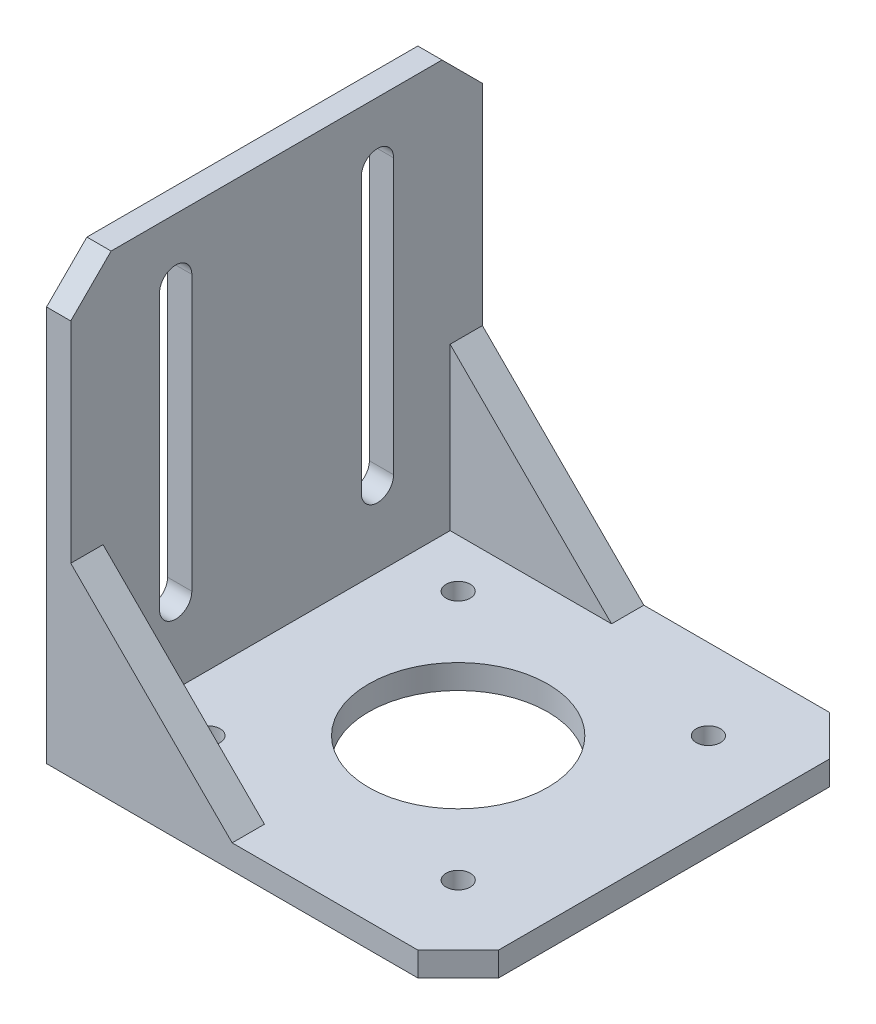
ISO-10303-21;
HEADER;
FILE_DESCRIPTION(('STEP AP214'),'2;1');
FILE_NAME('part.step','',(''),(''),'','','');
FILE_SCHEMA(('AUTOMOTIVE_DESIGN { 1 0 10303 214 1 1 1 1 }'));
ENDSEC;
DATA;
#1=APPLICATION_CONTEXT('core data for automotive mechanical design processes');
#2=APPLICATION_PROTOCOL_DEFINITION('international standard','automotive_design',2000,#1);
#3=PRODUCT_CONTEXT('',#1,'mechanical');
#4=PRODUCT('Part','Part','',(#3));
#5=PRODUCT_RELATED_PRODUCT_CATEGORY('part','',(#4));
#6=PRODUCT_DEFINITION_FORMATION('','',#4);
#7=PRODUCT_DEFINITION_CONTEXT('part definition',#1,'design');
#8=PRODUCT_DEFINITION('design','',#6,#7);
#9=PRODUCT_DEFINITION_SHAPE('','',#8);
#10=(LENGTH_UNIT() NAMED_UNIT(*) SI_UNIT(.MILLI.,.METRE.));
#11=(NAMED_UNIT(*) PLANE_ANGLE_UNIT() SI_UNIT($,.RADIAN.));
#12=(NAMED_UNIT(*) SI_UNIT($,.STERADIAN.) SOLID_ANGLE_UNIT());
#13=UNCERTAINTY_MEASURE_WITH_UNIT(LENGTH_MEASURE(1.E-05),#10,'distance_accuracy_value','');
#14=(GEOMETRIC_REPRESENTATION_CONTEXT(3) GLOBAL_UNCERTAINTY_ASSIGNED_CONTEXT((#13)) GLOBAL_UNIT_ASSIGNED_CONTEXT((#10,
#11,#12)) REPRESENTATION_CONTEXT('',''));
#15=CARTESIAN_POINT('',(0.,0.,0.));
#16=DIRECTION('',(0.,0.,1.));
#17=DIRECTION('',(1.,0.,0.));
#18=AXIS2_PLACEMENT_3D('',#15,#16,#17);
#19=CARTESIAN_POINT('',(0.,3.,0.));
#20=DIRECTION('',(0.,-1.,0.));
#21=DIRECTION('',(0.,0.,-1.));
#22=AXIS2_PLACEMENT_3D('',#19,#20,#21);
#23=PLANE('',#22);
#24=DIRECTION('',(-1.,0.,0.));
#25=VECTOR('',#24,1.);
#26=CARTESIAN_POINT('',(-25.5,3.,-25.5));
#27=LINE('',#26,#25);
#28=CARTESIAN_POINT('',(20.5,3.,-25.5));
#29=VERTEX_POINT('',#28);
#30=CARTESIAN_POINT('',(-2.49999999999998,3.,-25.5));
#31=VERTEX_POINT('',#30);
#32=EDGE_CURVE('E194',#29,#31,#27,.T.);
#33=ORIENTED_EDGE('',*,*,#32,.T.);
#34=DIRECTION('',(0.,0.,1.));
#35=VECTOR('',#34,1.);
#36=CARTESIAN_POINT('',(-2.49999999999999,3.,0.));
#37=LINE('',#36,#35);
#38=CARTESIAN_POINT('',(-2.49999999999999,3.,-21.5));
#39=VERTEX_POINT('',#38);
#40=EDGE_CURVE('E183',#31,#39,#37,.T.);
#41=ORIENTED_EDGE('',*,*,#40,.T.);
#42=DIRECTION('',(1.,0.,0.));
#43=VECTOR('',#42,1.);
#44=CARTESIAN_POINT('',(0.,3.,-21.5));
#45=LINE('',#44,#43);
#46=CARTESIAN_POINT('',(-22.5,3.,-21.5));
#47=VERTEX_POINT('',#46);
#48=EDGE_CURVE('E179',#47,#39,#45,.T.);
#49=ORIENTED_EDGE('',*,*,#48,.F.);
#50=DIRECTION('',(0.,0.,1.));
#51=VECTOR('',#50,1.);
#52=CARTESIAN_POINT('',(-22.5,3.,-25.5));
#53=LINE('',#52,#51);
#54=CARTESIAN_POINT('',(-22.5,3.,21.5));
#55=VERTEX_POINT('',#54);
#56=EDGE_CURVE('E54',#47,#55,#53,.T.);
#57=ORIENTED_EDGE('',*,*,#56,.T.);
#58=DIRECTION('',(-1.,0.,0.));
#59=VECTOR('',#58,1.);
#60=CARTESIAN_POINT('',(0.,3.,21.5));
#61=LINE('',#60,#59);
#62=CARTESIAN_POINT('',(-2.49999999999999,3.,21.5));
#63=VERTEX_POINT('',#62);
#64=EDGE_CURVE('E201',#63,#55,#61,.T.);
#65=ORIENTED_EDGE('',*,*,#64,.F.);
#66=DIRECTION('',(0.,0.,-1.));
#67=VECTOR('',#66,1.);
#68=CARTESIAN_POINT('',(-2.49999999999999,3.,0.));
#69=LINE('',#68,#67);
#70=CARTESIAN_POINT('',(-2.49999999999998,3.,25.5));
#71=VERTEX_POINT('',#70);
#72=EDGE_CURVE('E204',#63,#71,#69,.F.);
#73=ORIENTED_EDGE('',*,*,#72,.T.);
#74=DIRECTION('',(1.,0.,0.));
#75=VECTOR('',#74,1.);
#76=CARTESIAN_POINT('',(-25.5,3.,25.5));
#77=LINE('',#76,#75);
#78=CARTESIAN_POINT('',(20.5,3.,25.5));
#79=VERTEX_POINT('',#78);
#80=EDGE_CURVE('E336',#71,#79,#77,.T.);
#81=ORIENTED_EDGE('',*,*,#80,.T.);
#82=DIRECTION('',(0.707106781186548,0.,-0.707106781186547));
#83=VECTOR('',#82,1.);
#84=CARTESIAN_POINT('',(20.5,3.,25.5));
#85=LINE('',#84,#83);
#86=CARTESIAN_POINT('',(25.5,3.,20.5));
#87=VERTEX_POINT('',#86);
#88=EDGE_CURVE('E338',#79,#87,#85,.T.);
#89=ORIENTED_EDGE('',*,*,#88,.T.);
#90=DIRECTION('',(0.,0.,-1.));
#91=VECTOR('',#90,1.);
#92=CARTESIAN_POINT('',(25.5,3.,20.5));
#93=LINE('',#92,#91);
#94=CARTESIAN_POINT('',(25.5,3.,-20.5));
#95=VERTEX_POINT('',#94);
#96=EDGE_CURVE('E341',#87,#95,#93,.T.);
#97=ORIENTED_EDGE('',*,*,#96,.T.);
#98=DIRECTION('',(-0.707106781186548,0.,-0.707106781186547));
#99=VECTOR('',#98,1.);
#100=CARTESIAN_POINT('',(25.5,3.,-20.5));
#101=LINE('',#100,#99);
#102=EDGE_CURVE('E343',#95,#29,#101,.T.);
#103=ORIENTED_EDGE('',*,*,#102,.T.);
#104=EDGE_LOOP('',(#33,#41,#49,#57,#65,#73,#81,#89,#97,#103));
#105=FACE_BOUND('',#104,.T.);
#106=CARTESIAN_POINT('',(0.,3.,0.));
#107=DIRECTION('',(0.,1.,0.));
#108=DIRECTION('',(0.,0.,1.));
#109=AXIS2_PLACEMENT_3D('',#106,#107,#108);
#110=CIRCLE('',#109,11.1);
#111=CARTESIAN_POINT('',(0.,3.,11.1));
#112=VERTEX_POINT('',#111);
#113=EDGE_CURVE('E330',#112,#112,#110,.T.);
#114=ORIENTED_EDGE('',*,*,#113,.F.);
#115=EDGE_LOOP('',(#114));
#116=FACE_BOUND('',#115,.T.);
#117=CARTESIAN_POINT('',(15.5,3.,-15.5));
#118=DIRECTION('',(0.,1.,0.));
#119=DIRECTION('',(0.,0.,1.));
#120=AXIS2_PLACEMENT_3D('',#117,#118,#119);
#121=CIRCLE('',#120,1.5);
#122=CARTESIAN_POINT('',(15.5,3.,-14.));
#123=VERTEX_POINT('',#122);
#124=EDGE_CURVE('E324',#123,#123,#121,.T.);
#125=ORIENTED_EDGE('',*,*,#124,.F.);
#126=EDGE_LOOP('',(#125));
#127=FACE_BOUND('',#126,.T.);
#128=CARTESIAN_POINT('',(-15.5,3.,-15.5));
#129=DIRECTION('',(0.,1.,0.));
#130=DIRECTION('',(0.,0.,1.));
#131=AXIS2_PLACEMENT_3D('',#128,#129,#130);
#132=CIRCLE('',#131,1.5);
#133=CARTESIAN_POINT('',(-15.5,3.,-14.));
#134=VERTEX_POINT('',#133);
#135=EDGE_CURVE('E318',#134,#134,#132,.T.);
#136=ORIENTED_EDGE('',*,*,#135,.F.);
#137=EDGE_LOOP('',(#136));
#138=FACE_BOUND('',#137,.T.);
#139=CARTESIAN_POINT('',(-15.5,3.,15.5));
#140=DIRECTION('',(0.,1.,0.));
#141=DIRECTION('',(0.,0.,1.));
#142=AXIS2_PLACEMENT_3D('',#139,#140,#141);
#143=CIRCLE('',#142,1.5);
#144=CARTESIAN_POINT('',(-15.5,3.,17.));
#145=VERTEX_POINT('',#144);
#146=EDGE_CURVE('E312',#145,#145,#143,.T.);
#147=ORIENTED_EDGE('',*,*,#146,.F.);
#148=EDGE_LOOP('',(#147));
#149=FACE_BOUND('',#148,.T.);
#150=CARTESIAN_POINT('',(15.5,3.,15.5));
#151=DIRECTION('',(0.,1.,0.));
#152=DIRECTION('',(0.,0.,1.));
#153=AXIS2_PLACEMENT_3D('',#150,#151,#152);
#154=CIRCLE('',#153,1.5);
#155=CARTESIAN_POINT('',(15.5,3.,17.));
#156=VERTEX_POINT('',#155);
#157=EDGE_CURVE('E306',#156,#156,#154,.T.);
#158=ORIENTED_EDGE('',*,*,#157,.F.);
#159=EDGE_LOOP('',(#158));
#160=FACE_BOUND('',#159,.T.);
#161=ADVANCED_FACE('F32',(#105,#116,#127,#138,#149,#160),#23,.F.);
#162=CARTESIAN_POINT('',(0.,0.,0.));
#163=DIRECTION('',(0.,-1.,0.));
#164=DIRECTION('',(0.,0.,-1.));
#165=AXIS2_PLACEMENT_3D('',#162,#163,#164);
#166=PLANE('',#165);
#167=DIRECTION('',(0.,0.,1.));
#168=VECTOR('',#167,1.);
#169=CARTESIAN_POINT('',(-25.5,0.,25.5));
#170=LINE('',#169,#168);
#171=CARTESIAN_POINT('',(-25.5,0.,-25.5));
#172=VERTEX_POINT('',#171);
#173=CARTESIAN_POINT('',(-25.5,0.,25.5));
#174=VERTEX_POINT('',#173);
#175=EDGE_CURVE('E333',#172,#174,#170,.T.);
#176=ORIENTED_EDGE('',*,*,#175,.F.);
#177=DIRECTION('',(-1.,0.,0.));
#178=VECTOR('',#177,1.);
#179=CARTESIAN_POINT('',(-25.5,0.,-25.5));
#180=LINE('',#179,#178);
#181=CARTESIAN_POINT('',(20.5,0.,-25.5));
#182=VERTEX_POINT('',#181);
#183=EDGE_CURVE('E339',#182,#172,#180,.T.);
#184=ORIENTED_EDGE('',*,*,#183,.F.);
#185=DIRECTION('',(-0.707106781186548,0.,-0.707106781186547));
#186=VECTOR('',#185,1.);
#187=CARTESIAN_POINT('',(25.5,0.,-20.5));
#188=LINE('',#187,#186);
#189=CARTESIAN_POINT('',(25.5,0.,-20.5));
#190=VERTEX_POINT('',#189);
#191=EDGE_CURVE('E354',#190,#182,#188,.T.);
#192=ORIENTED_EDGE('',*,*,#191,.F.);
#193=DIRECTION('',(0.,0.,-1.));
#194=VECTOR('',#193,1.);
#195=CARTESIAN_POINT('',(25.5,0.,20.5));
#196=LINE('',#195,#194);
#197=CARTESIAN_POINT('',(25.5,0.,20.5));
#198=VERTEX_POINT('',#197);
#199=EDGE_CURVE('E352',#198,#190,#196,.T.);
#200=ORIENTED_EDGE('',*,*,#199,.F.);
#201=DIRECTION('',(0.707106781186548,0.,-0.707106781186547));
#202=VECTOR('',#201,1.);
#203=CARTESIAN_POINT('',(20.5,0.,25.5));
#204=LINE('',#203,#202);
#205=CARTESIAN_POINT('',(20.5,0.,25.5));
#206=VERTEX_POINT('',#205);
#207=EDGE_CURVE('E350',#206,#198,#204,.T.);
#208=ORIENTED_EDGE('',*,*,#207,.F.);
#209=DIRECTION('',(1.,0.,0.));
#210=VECTOR('',#209,1.);
#211=CARTESIAN_POINT('',(-25.5,0.,25.5));
#212=LINE('',#211,#210);
#213=EDGE_CURVE('E348',#174,#206,#212,.T.);
#214=ORIENTED_EDGE('',*,*,#213,.F.);
#215=EDGE_LOOP('',(#176,#184,#192,#200,#208,#214));
#216=FACE_BOUND('',#215,.T.);
#217=CARTESIAN_POINT('',(-15.5,0.,15.5));
#218=DIRECTION('',(0.,1.,0.));
#219=DIRECTION('',(0.,0.,1.));
#220=AXIS2_PLACEMENT_3D('',#217,#218,#219);
#221=CIRCLE('',#220,1.5);
#222=CARTESIAN_POINT('',(-15.5,0.,17.));
#223=VERTEX_POINT('',#222);
#224=EDGE_CURVE('E309',#223,#223,#221,.T.);
#225=ORIENTED_EDGE('',*,*,#224,.T.);
#226=EDGE_LOOP('',(#225));
#227=FACE_BOUND('',#226,.T.);
#228=CARTESIAN_POINT('',(15.5,0.,-15.5));
#229=DIRECTION('',(0.,1.,0.));
#230=DIRECTION('',(0.,0.,1.));
#231=AXIS2_PLACEMENT_3D('',#228,#229,#230);
#232=CIRCLE('',#231,1.5);
#233=CARTESIAN_POINT('',(15.5,0.,-14.));
#234=VERTEX_POINT('',#233);
#235=EDGE_CURVE('E321',#234,#234,#232,.T.);
#236=ORIENTED_EDGE('',*,*,#235,.T.);
#237=EDGE_LOOP('',(#236));
#238=FACE_BOUND('',#237,.T.);
#239=CARTESIAN_POINT('',(0.,0.,0.));
#240=DIRECTION('',(0.,1.,0.));
#241=DIRECTION('',(0.,0.,1.));
#242=AXIS2_PLACEMENT_3D('',#239,#240,#241);
#243=CIRCLE('',#242,11.1);
#244=CARTESIAN_POINT('',(0.,0.,11.1));
#245=VERTEX_POINT('',#244);
#246=EDGE_CURVE('E327',#245,#245,#243,.T.);
#247=ORIENTED_EDGE('',*,*,#246,.T.);
#248=EDGE_LOOP('',(#247));
#249=FACE_BOUND('',#248,.T.);
#250=CARTESIAN_POINT('',(-15.5,0.,-15.5));
#251=DIRECTION('',(0.,1.,0.));
#252=DIRECTION('',(0.,0.,1.));
#253=AXIS2_PLACEMENT_3D('',#250,#251,#252);
#254=CIRCLE('',#253,1.5);
#255=CARTESIAN_POINT('',(-15.5,0.,-14.));
#256=VERTEX_POINT('',#255);
#257=EDGE_CURVE('E315',#256,#256,#254,.T.);
#258=ORIENTED_EDGE('',*,*,#257,.T.);
#259=EDGE_LOOP('',(#258));
#260=FACE_BOUND('',#259,.T.);
#261=CARTESIAN_POINT('',(15.5,0.,15.5));
#262=DIRECTION('',(0.,1.,0.));
#263=DIRECTION('',(0.,0.,1.));
#264=AXIS2_PLACEMENT_3D('',#261,#262,#263);
#265=CIRCLE('',#264,1.5);
#266=CARTESIAN_POINT('',(15.5,0.,17.));
#267=VERTEX_POINT('',#266);
#268=EDGE_CURVE('E299',#267,#267,#265,.T.);
#269=ORIENTED_EDGE('',*,*,#268,.T.);
#270=EDGE_LOOP('',(#269));
#271=FACE_BOUND('',#270,.T.);
#272=ADVANCED_FACE('F430',(#216,#227,#238,#249,#260,#271),#166,.T.);
#273=CARTESIAN_POINT('',(-25.5,3.,25.5));
#274=DIRECTION('',(1.,0.,0.));
#275=DIRECTION('',(0.,0.,-1.));
#276=AXIS2_PLACEMENT_3D('',#273,#274,#275);
#277=PLANE('',#276);
#278=DIRECTION('',(0.,-1.,0.));
#279=VECTOR('',#278,1.);
#280=CARTESIAN_POINT('',(-25.5,3.,-25.5));
#281=LINE('',#280,#279);
#282=CARTESIAN_POINT('',(-25.5,49.,-25.5));
#283=VERTEX_POINT('',#282);
#284=EDGE_CURVE('E346',#283,#172,#281,.T.);
#285=ORIENTED_EDGE('',*,*,#284,.T.);
#286=ORIENTED_EDGE('',*,*,#175,.T.);
#287=DIRECTION('',(0.,-1.,0.));
#288=VECTOR('',#287,1.);
#289=CARTESIAN_POINT('',(-25.5,3.,25.5));
#290=LINE('',#289,#288);
#291=CARTESIAN_POINT('',(-25.5,49.,25.5));
#292=VERTEX_POINT('',#291);
#293=EDGE_CURVE('E371',#292,#174,#290,.T.);
#294=ORIENTED_EDGE('',*,*,#293,.F.);
#295=DIRECTION('',(0.,0.707106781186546,-0.707106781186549));
#296=VECTOR('',#295,1.);
#297=CARTESIAN_POINT('',(-25.5,54.,20.5));
#298=LINE('',#297,#296);
#299=CARTESIAN_POINT('',(-25.5,54.,20.5));
#300=VERTEX_POINT('',#299);
#301=EDGE_CURVE('E265',#292,#300,#298,.T.);
#302=ORIENTED_EDGE('',*,*,#301,.T.);
#303=DIRECTION('',(0.,0.,-1.));
#304=VECTOR('',#303,1.);
#305=CARTESIAN_POINT('',(-25.5,54.,-20.5));
#306=LINE('',#305,#304);
#307=CARTESIAN_POINT('',(-25.5,54.,-20.5));
#308=VERTEX_POINT('',#307);
#309=EDGE_CURVE('E291',#300,#308,#306,.T.);
#310=ORIENTED_EDGE('',*,*,#309,.T.);
#311=DIRECTION('',(0.,-0.707106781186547,-0.707106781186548));
#312=VECTOR('',#311,1.);
#313=CARTESIAN_POINT('',(-25.5,49.,-25.5));
#314=LINE('',#313,#312);
#315=EDGE_CURVE('E275',#308,#283,#314,.T.);
#316=ORIENTED_EDGE('',*,*,#315,.T.);
#317=EDGE_LOOP('',(#285,#286,#294,#302,#310,#316));
#318=FACE_BOUND('',#317,.T.);
#319=DIRECTION('',(0.,-1.,0.));
#320=VECTOR('',#319,1.);
#321=CARTESIAN_POINT('',(-25.5,46.5,10.5));
#322=LINE('',#321,#320);
#323=CARTESIAN_POINT('',(-25.5,46.5,10.5));
#324=VERTEX_POINT('',#323);
#325=CARTESIAN_POINT('',(-25.5,12.5,10.5));
#326=VERTEX_POINT('',#325);
#327=EDGE_CURVE('E223',#324,#326,#322,.T.);
#328=ORIENTED_EDGE('',*,*,#327,.F.);
#329=CARTESIAN_POINT('',(-25.5,46.5,12.5));
#330=DIRECTION('',(-1.,0.,0.));
#331=DIRECTION('',(0.,0.,1.));
#332=AXIS2_PLACEMENT_3D('',#329,#330,#331);
#333=CIRCLE('',#332,2.);
#334=CARTESIAN_POINT('',(-25.5,46.5,14.5));
#335=VERTEX_POINT('',#334);
#336=EDGE_CURVE('E207',#335,#324,#333,.T.);
#337=ORIENTED_EDGE('',*,*,#336,.F.);
#338=DIRECTION('',(0.,1.,0.));
#339=VECTOR('',#338,1.);
#340=CARTESIAN_POINT('',(-25.5,46.5,14.5));
#341=LINE('',#340,#339);
#342=CARTESIAN_POINT('',(-25.5,12.5,14.5));
#343=VERTEX_POINT('',#342);
#344=EDGE_CURVE('E212',#343,#335,#341,.T.);
#345=ORIENTED_EDGE('',*,*,#344,.F.);
#346=CARTESIAN_POINT('',(-25.5,12.5,12.5));
#347=DIRECTION('',(-1.,0.,0.));
#348=DIRECTION('',(0.,0.,1.));
#349=AXIS2_PLACEMENT_3D('',#346,#347,#348);
#350=CIRCLE('',#349,2.);
#351=EDGE_CURVE('E226',#326,#343,#350,.T.);
#352=ORIENTED_EDGE('',*,*,#351,.F.);
#353=EDGE_LOOP('',(#328,#337,#345,#352));
#354=FACE_BOUND('',#353,.T.);
#355=DIRECTION('',(0.,-1.,0.));
#356=VECTOR('',#355,1.);
#357=CARTESIAN_POINT('',(-25.5,46.5,-14.5));
#358=LINE('',#357,#356);
#359=CARTESIAN_POINT('',(-25.5,46.5,-14.5));
#360=VERTEX_POINT('',#359);
#361=CARTESIAN_POINT('',(-25.5,12.5,-14.5));
#362=VERTEX_POINT('',#361);
#363=EDGE_CURVE('E255',#360,#362,#358,.T.);
#364=ORIENTED_EDGE('',*,*,#363,.F.);
#365=CARTESIAN_POINT('',(-25.5,46.5,-12.5));
#366=DIRECTION('',(-1.,0.,0.));
#367=DIRECTION('',(0.,0.,1.));
#368=AXIS2_PLACEMENT_3D('',#365,#366,#367);
#369=CIRCLE('',#368,2.);
#370=CARTESIAN_POINT('',(-25.5,46.5,-10.5));
#371=VERTEX_POINT('',#370);
#372=EDGE_CURVE('E233',#371,#360,#369,.T.);
#373=ORIENTED_EDGE('',*,*,#372,.F.);
#374=DIRECTION('',(0.,1.,0.));
#375=VECTOR('',#374,1.);
#376=CARTESIAN_POINT('',(-25.5,46.5,-10.5));
#377=LINE('',#376,#375);
#378=CARTESIAN_POINT('',(-25.5,12.5,-10.5));
#379=VERTEX_POINT('',#378);
#380=EDGE_CURVE('E244',#379,#371,#377,.T.);
#381=ORIENTED_EDGE('',*,*,#380,.F.);
#382=CARTESIAN_POINT('',(-25.5,12.5,-12.5));
#383=DIRECTION('',(-1.,0.,0.));
#384=DIRECTION('',(0.,0.,1.));
#385=AXIS2_PLACEMENT_3D('',#382,#383,#384);
#386=CIRCLE('',#385,2.);
#387=EDGE_CURVE('E258',#362,#379,#386,.T.);
#388=ORIENTED_EDGE('',*,*,#387,.F.);
#389=EDGE_LOOP('',(#364,#373,#381,#388));
#390=FACE_BOUND('',#389,.T.);
#391=ADVANCED_FACE('F34',(#318,#354,#390),#277,.F.);
#392=CARTESIAN_POINT('',(-25.5,3.,25.5));
#393=DIRECTION('',(0.,0.,-1.));
#394=DIRECTION('',(-1.,0.,0.));
#395=AXIS2_PLACEMENT_3D('',#392,#393,#394);
#396=PLANE('',#395);
#397=ORIENTED_EDGE('',*,*,#80,.F.);
#398=DIRECTION('',(0.707106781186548,-0.707106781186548,0.));
#399=VECTOR('',#398,1.);
#400=CARTESIAN_POINT('',(-22.5,23.,25.5));
#401=LINE('',#400,#399);
#402=CARTESIAN_POINT('',(-22.5,23.,25.5));
#403=VERTEX_POINT('',#402);
#404=EDGE_CURVE('E198',#403,#71,#401,.T.);
#405=ORIENTED_EDGE('',*,*,#404,.F.);
#406=DIRECTION('',(0.,1.,0.));
#407=VECTOR('',#406,1.);
#408=CARTESIAN_POINT('',(-22.5,3.,25.5));
#409=LINE('',#408,#407);
#410=CARTESIAN_POINT('',(-22.5,49.,25.5));
#411=VERTEX_POINT('',#410);
#412=EDGE_CURVE('E277',#403,#411,#409,.T.);
#413=ORIENTED_EDGE('',*,*,#412,.T.);
#414=DIRECTION('',(-1.,0.,0.));
#415=VECTOR('',#414,1.);
#416=CARTESIAN_POINT('',(-22.5,49.,25.5));
#417=LINE('',#416,#415);
#418=EDGE_CURVE('E288',#411,#292,#417,.T.);
#419=ORIENTED_EDGE('',*,*,#418,.T.);
#420=ORIENTED_EDGE('',*,*,#293,.T.);
#421=ORIENTED_EDGE('',*,*,#213,.T.);
#422=DIRECTION('',(0.,-1.,0.));
#423=VECTOR('',#422,1.);
#424=CARTESIAN_POINT('',(20.5,3.,25.5));
#425=LINE('',#424,#423);
#426=EDGE_CURVE('E368',#79,#206,#425,.T.);
#427=ORIENTED_EDGE('',*,*,#426,.F.);
#428=EDGE_LOOP('',(#397,#405,#413,#419,#420,#421,#427));
#429=FACE_BOUND('',#428,.T.);
#430=ADVANCED_FACE('F393',(#429),#396,.F.);
#431=CARTESIAN_POINT('',(20.5,3.,25.5));
#432=DIRECTION('',(-0.707106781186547,0.,-0.707106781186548));
#433=DIRECTION('',(-0.707106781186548,0.,0.707106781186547));
#434=AXIS2_PLACEMENT_3D('',#431,#432,#433);
#435=PLANE('',#434);
#436=ORIENTED_EDGE('',*,*,#207,.T.);
#437=DIRECTION('',(0.,-1.,0.));
#438=VECTOR('',#437,1.);
#439=CARTESIAN_POINT('',(25.5,3.,20.5));
#440=LINE('',#439,#438);
#441=EDGE_CURVE('E365',#87,#198,#440,.T.);
#442=ORIENTED_EDGE('',*,*,#441,.F.);
#443=ORIENTED_EDGE('',*,*,#88,.F.);
#444=ORIENTED_EDGE('',*,*,#426,.T.);
#445=EDGE_LOOP('',(#436,#442,#443,#444));
#446=FACE_BOUND('',#445,.T.);
#447=ADVANCED_FACE('F399',(#446),#435,.F.);
#448=CARTESIAN_POINT('',(25.5,3.,20.5));
#449=DIRECTION('',(-1.,0.,0.));
#450=DIRECTION('',(0.,0.,1.));
#451=AXIS2_PLACEMENT_3D('',#448,#449,#450);
#452=PLANE('',#451);
#453=ORIENTED_EDGE('',*,*,#199,.T.);
#454=DIRECTION('',(0.,-1.,0.));
#455=VECTOR('',#454,1.);
#456=CARTESIAN_POINT('',(25.5,3.,-20.5));
#457=LINE('',#456,#455);
#458=EDGE_CURVE('E362',#95,#190,#457,.T.);
#459=ORIENTED_EDGE('',*,*,#458,.F.);
#460=ORIENTED_EDGE('',*,*,#96,.F.);
#461=ORIENTED_EDGE('',*,*,#441,.T.);
#462=EDGE_LOOP('',(#453,#459,#460,#461));
#463=FACE_BOUND('',#462,.T.);
#464=ADVANCED_FACE('F405',(#463),#452,.F.);
#465=CARTESIAN_POINT('',(25.5,3.,-20.5));
#466=DIRECTION('',(-0.707106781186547,0.,0.707106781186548));
#467=DIRECTION('',(0.707106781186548,0.,0.707106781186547));
#468=AXIS2_PLACEMENT_3D('',#465,#466,#467);
#469=PLANE('',#468);
#470=ORIENTED_EDGE('',*,*,#191,.T.);
#471=DIRECTION('',(0.,-1.,0.));
#472=VECTOR('',#471,1.);
#473=CARTESIAN_POINT('',(20.5,3.,-25.5));
#474=LINE('',#473,#472);
#475=EDGE_CURVE('E359',#29,#182,#474,.T.);
#476=ORIENTED_EDGE('',*,*,#475,.F.);
#477=ORIENTED_EDGE('',*,*,#102,.F.);
#478=ORIENTED_EDGE('',*,*,#458,.T.);
#479=EDGE_LOOP('',(#470,#476,#477,#478));
#480=FACE_BOUND('',#479,.T.);
#481=ADVANCED_FACE('F409',(#480),#469,.F.);
#482=CARTESIAN_POINT('',(-25.5,3.,-25.5));
#483=DIRECTION('',(0.,0.,1.));
#484=DIRECTION('',(1.,0.,0.));
#485=AXIS2_PLACEMENT_3D('',#482,#483,#484);
#486=PLANE('',#485);
#487=ORIENTED_EDGE('',*,*,#183,.T.);
#488=ORIENTED_EDGE('',*,*,#284,.F.);
#489=DIRECTION('',(-1.,0.,0.));
#490=VECTOR('',#489,1.);
#491=CARTESIAN_POINT('',(-22.5,49.,-25.5));
#492=LINE('',#491,#490);
#493=CARTESIAN_POINT('',(-22.5,49.,-25.5));
#494=VERTEX_POINT('',#493);
#495=EDGE_CURVE('E296',#494,#283,#492,.T.);
#496=ORIENTED_EDGE('',*,*,#495,.F.);
#497=DIRECTION('',(0.,-1.,0.));
#498=VECTOR('',#497,1.);
#499=CARTESIAN_POINT('',(-22.5,3.,-25.5));
#500=LINE('',#499,#498);
#501=CARTESIAN_POINT('',(-22.5,23.,-25.5));
#502=VERTEX_POINT('',#501);
#503=EDGE_CURVE('E272',#494,#502,#500,.T.);
#504=ORIENTED_EDGE('',*,*,#503,.T.);
#505=DIRECTION('',(0.707106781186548,-0.707106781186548,0.));
#506=VECTOR('',#505,1.);
#507=CARTESIAN_POINT('',(-22.5,23.,-25.5));
#508=LINE('',#507,#506);
#509=EDGE_CURVE('E184',#502,#31,#508,.T.);
#510=ORIENTED_EDGE('',*,*,#509,.T.);
#511=ORIENTED_EDGE('',*,*,#32,.F.);
#512=ORIENTED_EDGE('',*,*,#475,.T.);
#513=EDGE_LOOP('',(#487,#488,#496,#504,#510,#511,#512));
#514=FACE_BOUND('',#513,.T.);
#515=ADVANCED_FACE('F412',(#514),#486,.F.);
#516=CARTESIAN_POINT('',(0.,3.,0.));
#517=DIRECTION('',(0.,-1.,0.));
#518=DIRECTION('',(0.,0.,-1.));
#519=AXIS2_PLACEMENT_3D('',#516,#517,#518);
#520=CYLINDRICAL_SURFACE('',#519,11.1);
#521=ORIENTED_EDGE('',*,*,#113,.T.);
#522=EDGE_LOOP('',(#521));
#523=FACE_BOUND('',#522,.T.);
#524=ORIENTED_EDGE('',*,*,#246,.F.);
#525=EDGE_LOOP('',(#524));
#526=FACE_BOUND('',#525,.T.);
#527=ADVANCED_FACE('F471',(#523,#526),#520,.F.);
#528=CARTESIAN_POINT('',(15.5,3.,-15.5));
#529=DIRECTION('',(0.,-1.,0.));
#530=DIRECTION('',(0.,0.,-1.));
#531=AXIS2_PLACEMENT_3D('',#528,#529,#530);
#532=CYLINDRICAL_SURFACE('',#531,1.5);
#533=ORIENTED_EDGE('',*,*,#124,.T.);
#534=EDGE_LOOP('',(#533));
#535=FACE_BOUND('',#534,.T.);
#536=ORIENTED_EDGE('',*,*,#235,.F.);
#537=EDGE_LOOP('',(#536));
#538=FACE_BOUND('',#537,.T.);
#539=ADVANCED_FACE('F510',(#535,#538),#532,.F.);
#540=CARTESIAN_POINT('',(-15.5,3.,-15.5));
#541=DIRECTION('',(0.,-1.,0.));
#542=DIRECTION('',(0.,0.,-1.));
#543=AXIS2_PLACEMENT_3D('',#540,#541,#542);
#544=CYLINDRICAL_SURFACE('',#543,1.5);
#545=ORIENTED_EDGE('',*,*,#135,.T.);
#546=EDGE_LOOP('',(#545));
#547=FACE_BOUND('',#546,.T.);
#548=ORIENTED_EDGE('',*,*,#257,.F.);
#549=EDGE_LOOP('',(#548));
#550=FACE_BOUND('',#549,.T.);
#551=ADVANCED_FACE('F517',(#547,#550),#544,.F.);
#552=CARTESIAN_POINT('',(-15.5,3.,15.5));
#553=DIRECTION('',(0.,-1.,0.));
#554=DIRECTION('',(0.,0.,-1.));
#555=AXIS2_PLACEMENT_3D('',#552,#553,#554);
#556=CYLINDRICAL_SURFACE('',#555,1.5);
#557=ORIENTED_EDGE('',*,*,#146,.T.);
#558=EDGE_LOOP('',(#557));
#559=FACE_BOUND('',#558,.T.);
#560=ORIENTED_EDGE('',*,*,#224,.F.);
#561=EDGE_LOOP('',(#560));
#562=FACE_BOUND('',#561,.T.);
#563=ADVANCED_FACE('F524',(#559,#562),#556,.F.);
#564=CARTESIAN_POINT('',(15.5,3.,15.5));
#565=DIRECTION('',(0.,-1.,0.));
#566=DIRECTION('',(0.,0.,-1.));
#567=AXIS2_PLACEMENT_3D('',#564,#565,#566);
#568=CYLINDRICAL_SURFACE('',#567,1.5);
#569=ORIENTED_EDGE('',*,*,#157,.T.);
#570=EDGE_LOOP('',(#569));
#571=FACE_BOUND('',#570,.T.);
#572=ORIENTED_EDGE('',*,*,#268,.F.);
#573=EDGE_LOOP('',(#572));
#574=FACE_BOUND('',#573,.T.);
#575=ADVANCED_FACE('F532',(#571,#574),#568,.F.);
#576=CARTESIAN_POINT('',(-22.5,49.,-25.5));
#577=DIRECTION('',(0.,0.707106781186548,-0.707106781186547));
#578=DIRECTION('',(0.,0.707106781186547,0.707106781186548));
#579=AXIS2_PLACEMENT_3D('',#576,#577,#578);
#580=PLANE('',#579);
#581=ORIENTED_EDGE('',*,*,#315,.F.);
#582=DIRECTION('',(-1.,0.,0.));
#583=VECTOR('',#582,1.);
#584=CARTESIAN_POINT('',(-22.5,54.,-20.5));
#585=LINE('',#584,#583);
#586=CARTESIAN_POINT('',(-22.5,54.,-20.5));
#587=VERTEX_POINT('',#586);
#588=EDGE_CURVE('E300',#587,#308,#585,.T.);
#589=ORIENTED_EDGE('',*,*,#588,.F.);
#590=DIRECTION('',(0.,-0.707106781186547,-0.707106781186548));
#591=VECTOR('',#590,1.);
#592=CARTESIAN_POINT('',(-22.5,49.,-25.5));
#593=LINE('',#592,#591);
#594=EDGE_CURVE('E285',#587,#494,#593,.T.);
#595=ORIENTED_EDGE('',*,*,#594,.T.);
#596=ORIENTED_EDGE('',*,*,#495,.T.);
#597=EDGE_LOOP('',(#581,#589,#595,#596));
#598=FACE_BOUND('',#597,.T.);
#599=ADVANCED_FACE('F418',(#598),#580,.T.);
#600=CARTESIAN_POINT('',(-22.5,54.,-20.5));
#601=DIRECTION('',(0.,1.,0.));
#602=DIRECTION('',(0.,0.,1.));
#603=AXIS2_PLACEMENT_3D('',#600,#601,#602);
#604=PLANE('',#603);
#605=ORIENTED_EDGE('',*,*,#309,.F.);
#606=DIRECTION('',(-1.,0.,0.));
#607=VECTOR('',#606,1.);
#608=CARTESIAN_POINT('',(-22.5,54.,20.5));
#609=LINE('',#608,#607);
#610=CARTESIAN_POINT('',(-22.5,54.,20.5));
#611=VERTEX_POINT('',#610);
#612=EDGE_CURVE('E302',#611,#300,#609,.T.);
#613=ORIENTED_EDGE('',*,*,#612,.F.);
#614=DIRECTION('',(0.,0.,-1.));
#615=VECTOR('',#614,1.);
#616=CARTESIAN_POINT('',(-22.5,54.,-20.5));
#617=LINE('',#616,#615);
#618=EDGE_CURVE('E282',#611,#587,#617,.T.);
#619=ORIENTED_EDGE('',*,*,#618,.T.);
#620=ORIENTED_EDGE('',*,*,#588,.T.);
#621=EDGE_LOOP('',(#605,#613,#619,#620));
#622=FACE_BOUND('',#621,.T.);
#623=ADVANCED_FACE('F421',(#622),#604,.T.);
#624=CARTESIAN_POINT('',(-22.5,54.,20.5));
#625=DIRECTION('',(0.,0.707106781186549,0.707106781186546));
#626=DIRECTION('',(0.,-0.707106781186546,0.707106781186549));
#627=AXIS2_PLACEMENT_3D('',#624,#625,#626);
#628=PLANE('',#627);
#629=ORIENTED_EDGE('',*,*,#301,.F.);
#630=ORIENTED_EDGE('',*,*,#418,.F.);
#631=DIRECTION('',(0.,0.707106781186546,-0.707106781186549));
#632=VECTOR('',#631,1.);
#633=CARTESIAN_POINT('',(-22.5,54.,20.5));
#634=LINE('',#633,#632);
#635=EDGE_CURVE('E279',#411,#611,#634,.T.);
#636=ORIENTED_EDGE('',*,*,#635,.T.);
#637=ORIENTED_EDGE('',*,*,#612,.T.);
#638=EDGE_LOOP('',(#629,#630,#636,#637));
#639=FACE_BOUND('',#638,.T.);
#640=ADVANCED_FACE('F426',(#639),#628,.T.);
#641=CARTESIAN_POINT('',(-22.5,0.,0.));
#642=DIRECTION('',(1.,0.,0.));
#643=DIRECTION('',(0.,0.,-1.));
#644=AXIS2_PLACEMENT_3D('',#641,#642,#643);
#645=PLANE('',#644);
#646=DIRECTION('',(0.,0.,1.));
#647=VECTOR('',#646,1.);
#648=CARTESIAN_POINT('',(-22.5,23.,0.));
#649=LINE('',#648,#647);
#650=CARTESIAN_POINT('',(-22.5,23.,-21.5));
#651=VERTEX_POINT('',#650);
#652=EDGE_CURVE('E11',#502,#651,#649,.T.);
#653=ORIENTED_EDGE('',*,*,#652,.F.);
#654=ORIENTED_EDGE('',*,*,#503,.F.);
#655=ORIENTED_EDGE('',*,*,#594,.F.);
#656=ORIENTED_EDGE('',*,*,#618,.F.);
#657=ORIENTED_EDGE('',*,*,#635,.F.);
#658=ORIENTED_EDGE('',*,*,#412,.F.);
#659=DIRECTION('',(0.,0.,-1.));
#660=VECTOR('',#659,1.);
#661=CARTESIAN_POINT('',(-22.5,23.,0.));
#662=LINE('',#661,#660);
#663=CARTESIAN_POINT('',(-22.5,23.,21.5));
#664=VERTEX_POINT('',#663);
#665=EDGE_CURVE('E377',#664,#403,#662,.F.);
#666=ORIENTED_EDGE('',*,*,#665,.F.);
#667=DIRECTION('',(0.,-1.,0.));
#668=VECTOR('',#667,1.);
#669=CARTESIAN_POINT('',(-22.5,0.,21.5));
#670=LINE('',#669,#668);
#671=EDGE_CURVE('E374',#664,#55,#670,.T.);
#672=ORIENTED_EDGE('',*,*,#671,.T.);
#673=ORIENTED_EDGE('',*,*,#56,.F.);
#674=DIRECTION('',(0.,1.,0.));
#675=VECTOR('',#674,1.);
#676=CARTESIAN_POINT('',(-22.5,0.,-21.5));
#677=LINE('',#676,#675);
#678=EDGE_CURVE('E40',#47,#651,#677,.T.);
#679=ORIENTED_EDGE('',*,*,#678,.T.);
#680=EDGE_LOOP('',(#653,#654,#655,#656,#657,#658,#666,#672,#673,#679));
#681=FACE_BOUND('',#680,.T.);
#682=CARTESIAN_POINT('',(-22.5,46.5,12.5));
#683=DIRECTION('',(-1.,0.,0.));
#684=DIRECTION('',(0.,0.,1.));
#685=AXIS2_PLACEMENT_3D('',#682,#683,#684);
#686=CIRCLE('',#685,2.);
#687=CARTESIAN_POINT('',(-22.5,46.5,14.5));
#688=VERTEX_POINT('',#687);
#689=CARTESIAN_POINT('',(-22.5,46.5,10.5));
#690=VERTEX_POINT('',#689);
#691=EDGE_CURVE('E208',#688,#690,#686,.T.);
#692=ORIENTED_EDGE('',*,*,#691,.T.);
#693=DIRECTION('',(0.,-1.,0.));
#694=VECTOR('',#693,1.);
#695=CARTESIAN_POINT('',(-22.5,46.5,10.5));
#696=LINE('',#695,#694);
#697=CARTESIAN_POINT('',(-22.5,12.5,10.5));
#698=VERTEX_POINT('',#697);
#699=EDGE_CURVE('E211',#690,#698,#696,.T.);
#700=ORIENTED_EDGE('',*,*,#699,.T.);
#701=CARTESIAN_POINT('',(-22.5,12.5,12.5));
#702=DIRECTION('',(-1.,0.,0.));
#703=DIRECTION('',(0.,0.,1.));
#704=AXIS2_PLACEMENT_3D('',#701,#702,#703);
#705=CIRCLE('',#704,2.);
#706=CARTESIAN_POINT('',(-22.5,12.5,14.5));
#707=VERTEX_POINT('',#706);
#708=EDGE_CURVE('E215',#698,#707,#705,.T.);
#709=ORIENTED_EDGE('',*,*,#708,.T.);
#710=DIRECTION('',(0.,1.,0.));
#711=VECTOR('',#710,1.);
#712=CARTESIAN_POINT('',(-22.5,46.5,14.5));
#713=LINE('',#712,#711);
#714=EDGE_CURVE('E218',#707,#688,#713,.T.);
#715=ORIENTED_EDGE('',*,*,#714,.T.);
#716=EDGE_LOOP('',(#692,#700,#709,#715));
#717=FACE_BOUND('',#716,.T.);
#718=CARTESIAN_POINT('',(-22.5,46.5,-12.5));
#719=DIRECTION('',(-1.,0.,0.));
#720=DIRECTION('',(0.,0.,1.));
#721=AXIS2_PLACEMENT_3D('',#718,#719,#720);
#722=CIRCLE('',#721,2.);
#723=CARTESIAN_POINT('',(-22.5,46.5,-10.5));
#724=VERTEX_POINT('',#723);
#725=CARTESIAN_POINT('',(-22.5,46.5,-14.5));
#726=VERTEX_POINT('',#725);
#727=EDGE_CURVE('E240',#724,#726,#722,.T.);
#728=ORIENTED_EDGE('',*,*,#727,.T.);
#729=DIRECTION('',(0.,-1.,0.));
#730=VECTOR('',#729,1.);
#731=CARTESIAN_POINT('',(-22.5,46.5,-14.5));
#732=LINE('',#731,#730);
#733=CARTESIAN_POINT('',(-22.5,12.5,-14.5));
#734=VERTEX_POINT('',#733);
#735=EDGE_CURVE('E243',#726,#734,#732,.T.);
#736=ORIENTED_EDGE('',*,*,#735,.T.);
#737=CARTESIAN_POINT('',(-22.5,12.5,-12.5));
#738=DIRECTION('',(-1.,0.,0.));
#739=DIRECTION('',(0.,0.,1.));
#740=AXIS2_PLACEMENT_3D('',#737,#738,#739);
#741=CIRCLE('',#740,2.);
#742=CARTESIAN_POINT('',(-22.5,12.5,-10.5));
#743=VERTEX_POINT('',#742);
#744=EDGE_CURVE('E247',#734,#743,#741,.T.);
#745=ORIENTED_EDGE('',*,*,#744,.T.);
#746=DIRECTION('',(0.,1.,0.));
#747=VECTOR('',#746,1.);
#748=CARTESIAN_POINT('',(-22.5,46.5,-10.5));
#749=LINE('',#748,#747);
#750=EDGE_CURVE('E250',#743,#724,#749,.T.);
#751=ORIENTED_EDGE('',*,*,#750,.T.);
#752=EDGE_LOOP('',(#728,#736,#745,#751));
#753=FACE_BOUND('',#752,.T.);
#754=ADVANCED_FACE('F379',(#681,#717,#753),#645,.T.);
#755=CARTESIAN_POINT('',(-22.5,46.5,-12.5));
#756=DIRECTION('',(-1.,0.,0.));
#757=DIRECTION('',(0.,0.,1.));
#758=AXIS2_PLACEMENT_3D('',#755,#756,#757);
#759=CYLINDRICAL_SURFACE('',#758,2.);
#760=ORIENTED_EDGE('',*,*,#372,.T.);
#761=DIRECTION('',(-1.,0.,0.));
#762=VECTOR('',#761,1.);
#763=CARTESIAN_POINT('',(-22.5,46.5,-14.5));
#764=LINE('',#763,#762);
#765=EDGE_CURVE('E253',#726,#360,#764,.T.);
#766=ORIENTED_EDGE('',*,*,#765,.F.);
#767=ORIENTED_EDGE('',*,*,#727,.F.);
#768=DIRECTION('',(-1.,0.,0.));
#769=VECTOR('',#768,1.);
#770=CARTESIAN_POINT('',(-22.5,46.5,-10.5));
#771=LINE('',#770,#769);
#772=EDGE_CURVE('E263',#724,#371,#771,.T.);
#773=ORIENTED_EDGE('',*,*,#772,.T.);
#774=EDGE_LOOP('',(#760,#766,#767,#773));
#775=FACE_BOUND('',#774,.T.);
#776=ADVANCED_FACE('F448',(#775),#759,.F.);
#777=CARTESIAN_POINT('',(-22.5,46.5,-10.5));
#778=DIRECTION('',(0.,0.,1.));
#779=DIRECTION('',(0.,-1.,0.));
#780=AXIS2_PLACEMENT_3D('',#777,#778,#779);
#781=PLANE('',#780);
#782=ORIENTED_EDGE('',*,*,#380,.T.);
#783=ORIENTED_EDGE('',*,*,#772,.F.);
#784=ORIENTED_EDGE('',*,*,#750,.F.);
#785=DIRECTION('',(-1.,0.,0.));
#786=VECTOR('',#785,1.);
#787=CARTESIAN_POINT('',(-22.5,12.5,-10.5));
#788=LINE('',#787,#786);
#789=EDGE_CURVE('E266',#743,#379,#788,.T.);
#790=ORIENTED_EDGE('',*,*,#789,.T.);
#791=EDGE_LOOP('',(#782,#783,#784,#790));
#792=FACE_BOUND('',#791,.T.);
#793=ADVANCED_FACE('F451',(#792),#781,.F.);
#794=CARTESIAN_POINT('',(-22.5,12.5,-12.5));
#795=DIRECTION('',(-1.,0.,0.));
#796=DIRECTION('',(0.,0.,1.));
#797=AXIS2_PLACEMENT_3D('',#794,#795,#796);
#798=CYLINDRICAL_SURFACE('',#797,2.);
#799=ORIENTED_EDGE('',*,*,#387,.T.);
#800=ORIENTED_EDGE('',*,*,#789,.F.);
#801=ORIENTED_EDGE('',*,*,#744,.F.);
#802=DIRECTION('',(-1.,0.,0.));
#803=VECTOR('',#802,1.);
#804=CARTESIAN_POINT('',(-22.5,12.5,-14.5));
#805=LINE('',#804,#803);
#806=EDGE_CURVE('E268',#734,#362,#805,.T.);
#807=ORIENTED_EDGE('',*,*,#806,.T.);
#808=EDGE_LOOP('',(#799,#800,#801,#807));
#809=FACE_BOUND('',#808,.T.);
#810=ADVANCED_FACE('F453',(#809),#798,.F.);
#811=CARTESIAN_POINT('',(-22.5,46.5,-14.5));
#812=DIRECTION('',(0.,0.,-1.));
#813=DIRECTION('',(0.,1.,0.));
#814=AXIS2_PLACEMENT_3D('',#811,#812,#813);
#815=PLANE('',#814);
#816=ORIENTED_EDGE('',*,*,#363,.T.);
#817=ORIENTED_EDGE('',*,*,#806,.F.);
#818=ORIENTED_EDGE('',*,*,#735,.F.);
#819=ORIENTED_EDGE('',*,*,#765,.T.);
#820=EDGE_LOOP('',(#816,#817,#818,#819));
#821=FACE_BOUND('',#820,.T.);
#822=ADVANCED_FACE('F444',(#821),#815,.F.);
#823=CARTESIAN_POINT('',(-22.5,46.5,12.5));
#824=DIRECTION('',(-1.,0.,0.));
#825=DIRECTION('',(0.,0.,1.));
#826=AXIS2_PLACEMENT_3D('',#823,#824,#825);
#827=CYLINDRICAL_SURFACE('',#826,2.);
#828=ORIENTED_EDGE('',*,*,#336,.T.);
#829=DIRECTION('',(-1.,0.,0.));
#830=VECTOR('',#829,1.);
#831=CARTESIAN_POINT('',(-22.5,46.5,10.5));
#832=LINE('',#831,#830);
#833=EDGE_CURVE('E221',#690,#324,#832,.T.);
#834=ORIENTED_EDGE('',*,*,#833,.F.);
#835=ORIENTED_EDGE('',*,*,#691,.F.);
#836=DIRECTION('',(-1.,0.,0.));
#837=VECTOR('',#836,1.);
#838=CARTESIAN_POINT('',(-22.5,46.5,14.5));
#839=LINE('',#838,#837);
#840=EDGE_CURVE('E231',#688,#335,#839,.T.);
#841=ORIENTED_EDGE('',*,*,#840,.T.);
#842=EDGE_LOOP('',(#828,#834,#835,#841));
#843=FACE_BOUND('',#842,.T.);
#844=ADVANCED_FACE('F588',(#843),#827,.F.);
#845=CARTESIAN_POINT('',(-22.5,46.5,14.5));
#846=DIRECTION('',(0.,0.,1.));
#847=DIRECTION('',(0.,-1.,0.));
#848=AXIS2_PLACEMENT_3D('',#845,#846,#847);
#849=PLANE('',#848);
#850=ORIENTED_EDGE('',*,*,#344,.T.);
#851=ORIENTED_EDGE('',*,*,#840,.F.);
#852=ORIENTED_EDGE('',*,*,#714,.F.);
#853=DIRECTION('',(-1.,0.,0.));
#854=VECTOR('',#853,1.);
#855=CARTESIAN_POINT('',(-22.5,12.5,14.5));
#856=LINE('',#855,#854);
#857=EDGE_CURVE('E234',#707,#343,#856,.T.);
#858=ORIENTED_EDGE('',*,*,#857,.T.);
#859=EDGE_LOOP('',(#850,#851,#852,#858));
#860=FACE_BOUND('',#859,.T.);
#861=ADVANCED_FACE('F597',(#860),#849,.F.);
#862=CARTESIAN_POINT('',(-22.5,12.5,12.5));
#863=DIRECTION('',(-1.,0.,0.));
#864=DIRECTION('',(0.,0.,1.));
#865=AXIS2_PLACEMENT_3D('',#862,#863,#864);
#866=CYLINDRICAL_SURFACE('',#865,2.);
#867=ORIENTED_EDGE('',*,*,#351,.T.);
#868=ORIENTED_EDGE('',*,*,#857,.F.);
#869=ORIENTED_EDGE('',*,*,#708,.F.);
#870=DIRECTION('',(-1.,0.,0.));
#871=VECTOR('',#870,1.);
#872=CARTESIAN_POINT('',(-22.5,12.5,10.5));
#873=LINE('',#872,#871);
#874=EDGE_CURVE('E236',#698,#326,#873,.T.);
#875=ORIENTED_EDGE('',*,*,#874,.T.);
#876=EDGE_LOOP('',(#867,#868,#869,#875));
#877=FACE_BOUND('',#876,.T.);
#878=ADVANCED_FACE('F607',(#877),#866,.F.);
#879=CARTESIAN_POINT('',(-22.5,46.5,10.5));
#880=DIRECTION('',(0.,0.,-1.));
#881=DIRECTION('',(0.,1.,0.));
#882=AXIS2_PLACEMENT_3D('',#879,#880,#881);
#883=PLANE('',#882);
#884=ORIENTED_EDGE('',*,*,#327,.T.);
#885=ORIENTED_EDGE('',*,*,#874,.F.);
#886=ORIENTED_EDGE('',*,*,#699,.F.);
#887=ORIENTED_EDGE('',*,*,#833,.T.);
#888=EDGE_LOOP('',(#884,#885,#886,#887));
#889=FACE_BOUND('',#888,.T.);
#890=ADVANCED_FACE('F616',(#889),#883,.F.);
#891=CARTESIAN_POINT('',(-22.5,23.,25.5));
#892=DIRECTION('',(-0.707106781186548,-0.707106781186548,0.));
#893=DIRECTION('',(0.707106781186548,-0.707106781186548,0.));
#894=AXIS2_PLACEMENT_3D('',#891,#892,#893);
#895=PLANE('',#894);
#896=ORIENTED_EDGE('',*,*,#72,.F.);
#897=DIRECTION('',(0.707106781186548,-0.707106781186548,0.));
#898=VECTOR('',#897,1.);
#899=CARTESIAN_POINT('',(-22.5,23.,21.5));
#900=LINE('',#899,#898);
#901=EDGE_CURVE('E195',#664,#63,#900,.T.);
#902=ORIENTED_EDGE('',*,*,#901,.F.);
#903=ORIENTED_EDGE('',*,*,#665,.T.);
#904=ORIENTED_EDGE('',*,*,#404,.T.);
#905=EDGE_LOOP('',(#896,#902,#903,#904));
#906=FACE_BOUND('',#905,.T.);
#907=ADVANCED_FACE('F388',(#906),#895,.F.);
#908=CARTESIAN_POINT('',(0.,27.,21.5));
#909=DIRECTION('',(0.,0.,1.));
#910=DIRECTION('',(1.,0.,0.));
#911=AXIS2_PLACEMENT_3D('',#908,#909,#910);
#912=PLANE('',#911);
#913=ORIENTED_EDGE('',*,*,#901,.T.);
#914=ORIENTED_EDGE('',*,*,#64,.T.);
#915=ORIENTED_EDGE('',*,*,#671,.F.);
#916=EDGE_LOOP('',(#913,#914,#915));
#917=FACE_BOUND('',#916,.T.);
#918=ADVANCED_FACE('F386',(#917),#912,.F.);
#919=CARTESIAN_POINT('',(-22.5,23.,-25.5));
#920=DIRECTION('',(0.707106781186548,0.707106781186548,0.));
#921=DIRECTION('',(0.707106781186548,-0.707106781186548,0.));
#922=AXIS2_PLACEMENT_3D('',#919,#920,#921);
#923=PLANE('',#922);
#924=ORIENTED_EDGE('',*,*,#40,.F.);
#925=ORIENTED_EDGE('',*,*,#509,.F.);
#926=ORIENTED_EDGE('',*,*,#652,.T.);
#927=DIRECTION('',(0.707106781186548,-0.707106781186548,0.));
#928=VECTOR('',#927,1.);
#929=CARTESIAN_POINT('',(-22.5,23.,-21.5));
#930=LINE('',#929,#928);
#931=EDGE_CURVE('E47',#651,#39,#930,.T.);
#932=ORIENTED_EDGE('',*,*,#931,.T.);
#933=EDGE_LOOP('',(#924,#925,#926,#932));
#934=FACE_BOUND('',#933,.T.);
#935=ADVANCED_FACE('F187',(#934),#923,.T.);
#936=CARTESIAN_POINT('',(0.,27.,-21.5));
#937=DIRECTION('',(0.,0.,-1.));
#938=DIRECTION('',(-1.,0.,0.));
#939=AXIS2_PLACEMENT_3D('',#936,#937,#938);
#940=PLANE('',#939);
#941=ORIENTED_EDGE('',*,*,#678,.F.);
#942=ORIENTED_EDGE('',*,*,#48,.T.);
#943=ORIENTED_EDGE('',*,*,#931,.F.);
#944=EDGE_LOOP('',(#941,#942,#943));
#945=FACE_BOUND('',#944,.T.);
#946=ADVANCED_FACE('F180',(#945),#940,.F.);
#947=CLOSED_SHELL('',(#161,#272,#391,#430,#447,#464,#481,#515,#527,#539,#551,#563,#575,#599,
#623,#640,#754,#776,#793,#810,#822,#844,#861,#878,#890,#907,#918,#935,#946));
#948=MANIFOLD_SOLID_BREP('B2',#947);
#949=ADVANCED_BREP_SHAPE_REPRESENTATION('',(#18,#948),#14);
#950=SHAPE_DEFINITION_REPRESENTATION(#9,#949);
ENDSEC;
END-ISO-10303-21;
